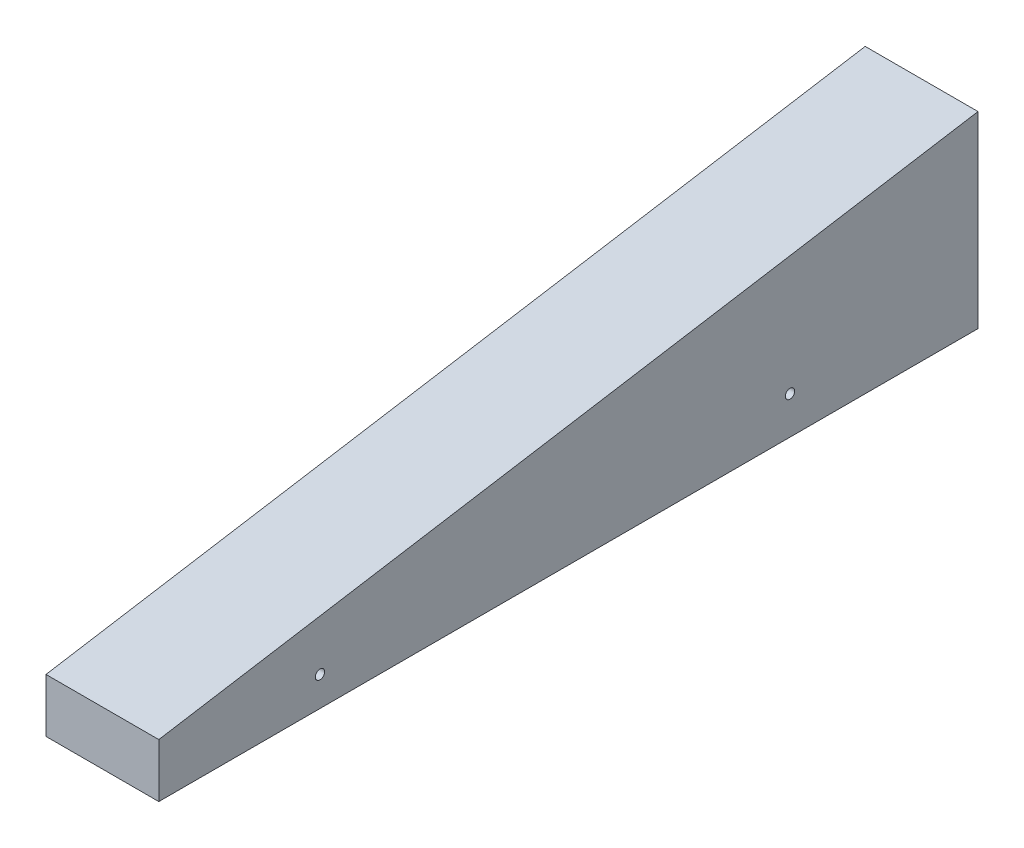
ISO-10303-21;
HEADER;
FILE_DESCRIPTION(('STEP AP214'),'2;1');
FILE_NAME('part.step','',(''),(''),'','','');
FILE_SCHEMA(('AUTOMOTIVE_DESIGN { 1 0 10303 214 1 1 1 1 }'));
ENDSEC;
DATA;
#1=APPLICATION_CONTEXT('core data for automotive mechanical design processes');
#2=APPLICATION_PROTOCOL_DEFINITION('international standard','automotive_design',2000,#1);
#3=PRODUCT_CONTEXT('',#1,'mechanical');
#4=PRODUCT('Part','Part','',(#3));
#5=PRODUCT_RELATED_PRODUCT_CATEGORY('part','',(#4));
#6=PRODUCT_DEFINITION_FORMATION('','',#4);
#7=PRODUCT_DEFINITION_CONTEXT('part definition',#1,'design');
#8=PRODUCT_DEFINITION('design','',#6,#7);
#9=PRODUCT_DEFINITION_SHAPE('','',#8);
#10=(LENGTH_UNIT() NAMED_UNIT(*) SI_UNIT(.MILLI.,.METRE.));
#11=(NAMED_UNIT(*) PLANE_ANGLE_UNIT() SI_UNIT($,.RADIAN.));
#12=(NAMED_UNIT(*) SI_UNIT($,.STERADIAN.) SOLID_ANGLE_UNIT());
#13=UNCERTAINTY_MEASURE_WITH_UNIT(LENGTH_MEASURE(1.E-05),#10,'distance_accuracy_value','');
#14=(GEOMETRIC_REPRESENTATION_CONTEXT(3) GLOBAL_UNCERTAINTY_ASSIGNED_CONTEXT((#13)) GLOBAL_UNIT_ASSIGNED_CONTEXT((#10,
#11,#12)) REPRESENTATION_CONTEXT('',''));
#15=CARTESIAN_POINT('',(0.,0.,0.));
#16=DIRECTION('',(0.,0.,1.));
#17=DIRECTION('',(1.,0.,0.));
#18=AXIS2_PLACEMENT_3D('',#15,#16,#17);
#19=CARTESIAN_POINT('',(21.,0.,152.5));
#20=DIRECTION('',(0.,0.,-1.));
#21=DIRECTION('',(-1.,0.,0.));
#22=AXIS2_PLACEMENT_3D('',#19,#20,#21);
#23=PLANE('',#22);
#24=DIRECTION('',(0.,-1.,0.));
#25=VECTOR('',#24,1.);
#26=CARTESIAN_POINT('',(-21.,0.,152.5));
#27=LINE('',#26,#25);
#28=CARTESIAN_POINT('',(-21.,20.,152.5));
#29=VERTEX_POINT('',#28);
#30=CARTESIAN_POINT('',(-21.,0.,152.5));
#31=VERTEX_POINT('',#30);
#32=EDGE_CURVE('E97',#29,#31,#27,.T.);
#33=ORIENTED_EDGE('',*,*,#32,.T.);
#34=DIRECTION('',(-1.,0.,0.));
#35=VECTOR('',#34,1.);
#36=CARTESIAN_POINT('',(21.,0.,152.5));
#37=LINE('',#36,#35);
#38=CARTESIAN_POINT('',(21.,0.,152.5));
#39=VERTEX_POINT('',#38);
#40=EDGE_CURVE('E11',#39,#31,#37,.T.);
#41=ORIENTED_EDGE('',*,*,#40,.F.);
#42=DIRECTION('',(0.,-1.,0.));
#43=VECTOR('',#42,1.);
#44=CARTESIAN_POINT('',(21.,0.,152.5));
#45=LINE('',#44,#43);
#46=CARTESIAN_POINT('',(21.,20.,152.5));
#47=VERTEX_POINT('',#46);
#48=EDGE_CURVE('E85',#47,#39,#45,.T.);
#49=ORIENTED_EDGE('',*,*,#48,.F.);
#50=DIRECTION('',(-1.,0.,0.));
#51=VECTOR('',#50,1.);
#52=CARTESIAN_POINT('',(21.,20.,152.5));
#53=LINE('',#52,#51);
#54=EDGE_CURVE('E93',#47,#29,#53,.T.);
#55=ORIENTED_EDGE('',*,*,#54,.T.);
#56=EDGE_LOOP('',(#33,#41,#49,#55));
#57=FACE_BOUND('',#56,.T.);
#58=ADVANCED_FACE('F34',(#57),#23,.F.);
#59=CARTESIAN_POINT('',(21.,0.,152.5));
#60=DIRECTION('',(0.,1.,0.));
#61=DIRECTION('',(0.,0.,1.));
#62=AXIS2_PLACEMENT_3D('',#59,#60,#61);
#63=PLANE('',#62);
#64=DIRECTION('',(0.,0.,-1.));
#65=VECTOR('',#64,1.);
#66=CARTESIAN_POINT('',(-21.,0.,152.5));
#67=LINE('',#66,#65);
#68=CARTESIAN_POINT('',(-21.,0.,-152.5));
#69=VERTEX_POINT('',#68);
#70=EDGE_CURVE('E89',#31,#69,#67,.T.);
#71=ORIENTED_EDGE('',*,*,#70,.T.);
#72=DIRECTION('',(-1.,0.,0.));
#73=VECTOR('',#72,1.);
#74=CARTESIAN_POINT('',(21.,0.,-152.5));
#75=LINE('',#74,#73);
#76=CARTESIAN_POINT('',(21.,0.,-152.5));
#77=VERTEX_POINT('',#76);
#78=EDGE_CURVE('E42',#77,#69,#75,.T.);
#79=ORIENTED_EDGE('',*,*,#78,.F.);
#80=DIRECTION('',(0.,0.,-1.));
#81=VECTOR('',#80,1.);
#82=CARTESIAN_POINT('',(21.,0.,152.5));
#83=LINE('',#82,#81);
#84=EDGE_CURVE('E80',#39,#77,#83,.T.);
#85=ORIENTED_EDGE('',*,*,#84,.F.);
#86=ORIENTED_EDGE('',*,*,#40,.T.);
#87=EDGE_LOOP('',(#71,#79,#85,#86));
#88=FACE_BOUND('',#87,.T.);
#89=ADVANCED_FACE('F88',(#88),#63,.F.);
#90=CARTESIAN_POINT('',(21.,0.,-152.5));
#91=DIRECTION('',(0.,0.,1.));
#92=DIRECTION('',(1.,0.,0.));
#93=AXIS2_PLACEMENT_3D('',#90,#91,#92);
#94=PLANE('',#93);
#95=CARTESIAN_POINT('',(0.,32.,-152.5));
#96=DIRECTION('',(0.,0.,-1.));
#97=DIRECTION('',(-1.,0.,0.));
#98=AXIS2_PLACEMENT_3D('',#95,#96,#97);
#99=CIRCLE('',#98,10.);
#100=CARTESIAN_POINT('',(-10.,32.,-152.5));
#101=VERTEX_POINT('',#100);
#102=EDGE_CURVE('E111',#101,#101,#99,.T.);
#103=ORIENTED_EDGE('',*,*,#102,.F.);
#104=EDGE_LOOP('',(#103));
#105=FACE_BOUND('',#104,.T.);
#106=DIRECTION('',(0.,1.,0.));
#107=VECTOR('',#106,1.);
#108=CARTESIAN_POINT('',(-21.,0.,-152.5));
#109=LINE('',#108,#107);
#110=CARTESIAN_POINT('',(-21.,70.,-152.5));
#111=VERTEX_POINT('',#110);
#112=EDGE_CURVE('E67',#69,#111,#109,.T.);
#113=ORIENTED_EDGE('',*,*,#112,.T.);
#114=DIRECTION('',(-1.,0.,0.));
#115=VECTOR('',#114,1.);
#116=CARTESIAN_POINT('',(21.,70.,-152.5));
#117=LINE('',#116,#115);
#118=CARTESIAN_POINT('',(21.,70.,-152.5));
#119=VERTEX_POINT('',#118);
#120=EDGE_CURVE('E90',#119,#111,#117,.T.);
#121=ORIENTED_EDGE('',*,*,#120,.F.);
#122=DIRECTION('',(0.,1.,0.));
#123=VECTOR('',#122,1.);
#124=CARTESIAN_POINT('',(21.,0.,-152.5));
#125=LINE('',#124,#123);
#126=EDGE_CURVE('E83',#77,#119,#125,.T.);
#127=ORIENTED_EDGE('',*,*,#126,.F.);
#128=ORIENTED_EDGE('',*,*,#78,.T.);
#129=EDGE_LOOP('',(#113,#121,#127,#128));
#130=FACE_BOUND('',#129,.T.);
#131=ADVANCED_FACE('F91',(#105,#130),#94,.F.);
#132=CARTESIAN_POINT('',(21.,20.,152.5));
#133=DIRECTION('',(0.,-0.986827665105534,-0.161775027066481));
#134=DIRECTION('',(0.,0.161775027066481,-0.986827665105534));
#135=AXIS2_PLACEMENT_3D('',#132,#133,#134);
#136=PLANE('',#135);
#137=DIRECTION('',(0.,-0.161775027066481,0.986827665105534));
#138=VECTOR('',#137,1.);
#139=CARTESIAN_POINT('',(-21.,20.,152.5));
#140=LINE('',#139,#138);
#141=EDGE_CURVE('E73',#111,#29,#140,.T.);
#142=ORIENTED_EDGE('',*,*,#141,.T.);
#143=ORIENTED_EDGE('',*,*,#54,.F.);
#144=DIRECTION('',(0.,-0.161775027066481,0.986827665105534));
#145=VECTOR('',#144,1.);
#146=CARTESIAN_POINT('',(21.,20.,152.5));
#147=LINE('',#146,#145);
#148=EDGE_CURVE('E50',#119,#47,#147,.T.);
#149=ORIENTED_EDGE('',*,*,#148,.F.);
#150=ORIENTED_EDGE('',*,*,#120,.T.);
#151=EDGE_LOOP('',(#142,#143,#149,#150));
#152=FACE_BOUND('',#151,.T.);
#153=ADVANCED_FACE('F105',(#152),#136,.F.);
#154=CARTESIAN_POINT('',(21.,0.,152.5));
#155=DIRECTION('',(-1.,0.,0.));
#156=DIRECTION('',(0.,0.,1.));
#157=AXIS2_PLACEMENT_3D('',#154,#155,#156);
#158=PLANE('',#157);
#159=CARTESIAN_POINT('',(21.,14.,-82.5));
#160=DIRECTION('',(1.,0.,0.));
#161=DIRECTION('',(0.,0.,-1.));
#162=AXIS2_PLACEMENT_3D('',#159,#160,#161);
#163=CIRCLE('',#162,1.75);
#164=CARTESIAN_POINT('',(21.,14.,-84.25));
#165=VERTEX_POINT('',#164);
#166=EDGE_CURVE('E125',#165,#165,#163,.T.);
#167=ORIENTED_EDGE('',*,*,#166,.F.);
#168=EDGE_LOOP('',(#167));
#169=FACE_BOUND('',#168,.T.);
#170=CARTESIAN_POINT('',(21.,11.,92.5));
#171=DIRECTION('',(1.,0.,0.));
#172=DIRECTION('',(0.,0.,-1.));
#173=AXIS2_PLACEMENT_3D('',#170,#171,#172);
#174=CIRCLE('',#173,1.75);
#175=CARTESIAN_POINT('',(21.,11.,90.75));
#176=VERTEX_POINT('',#175);
#177=EDGE_CURVE('E119',#176,#176,#174,.T.);
#178=ORIENTED_EDGE('',*,*,#177,.F.);
#179=EDGE_LOOP('',(#178));
#180=FACE_BOUND('',#179,.T.);
#181=ORIENTED_EDGE('',*,*,#48,.T.);
#182=ORIENTED_EDGE('',*,*,#84,.T.);
#183=ORIENTED_EDGE('',*,*,#126,.T.);
#184=ORIENTED_EDGE('',*,*,#148,.T.);
#185=EDGE_LOOP('',(#181,#182,#183,#184));
#186=FACE_BOUND('',#185,.T.);
#187=ADVANCED_FACE('F81',(#169,#180,#186),#158,.F.);
#188=CARTESIAN_POINT('',(-21.,0.,152.5));
#189=DIRECTION('',(-1.,0.,0.));
#190=DIRECTION('',(0.,0.,1.));
#191=AXIS2_PLACEMENT_3D('',#188,#189,#190);
#192=PLANE('',#191);
#193=CARTESIAN_POINT('',(-21.,14.,-82.5));
#194=DIRECTION('',(1.,0.,0.));
#195=DIRECTION('',(0.,0.,-1.));
#196=AXIS2_PLACEMENT_3D('',#193,#194,#195);
#197=CIRCLE('',#196,1.75);
#198=CARTESIAN_POINT('',(-21.,14.,-84.25));
#199=VERTEX_POINT('',#198);
#200=EDGE_CURVE('E122',#199,#199,#197,.T.);
#201=ORIENTED_EDGE('',*,*,#200,.T.);
#202=EDGE_LOOP('',(#201));
#203=FACE_BOUND('',#202,.T.);
#204=CARTESIAN_POINT('',(-21.,11.,92.5));
#205=DIRECTION('',(1.,0.,0.));
#206=DIRECTION('',(0.,0.,-1.));
#207=AXIS2_PLACEMENT_3D('',#204,#205,#206);
#208=CIRCLE('',#207,1.75);
#209=CARTESIAN_POINT('',(-21.,11.,90.75));
#210=VERTEX_POINT('',#209);
#211=EDGE_CURVE('E114',#210,#210,#208,.T.);
#212=ORIENTED_EDGE('',*,*,#211,.T.);
#213=EDGE_LOOP('',(#212));
#214=FACE_BOUND('',#213,.T.);
#215=ORIENTED_EDGE('',*,*,#32,.F.);
#216=ORIENTED_EDGE('',*,*,#141,.F.);
#217=ORIENTED_EDGE('',*,*,#112,.F.);
#218=ORIENTED_EDGE('',*,*,#70,.F.);
#219=EDGE_LOOP('',(#215,#216,#217,#218));
#220=FACE_BOUND('',#219,.T.);
#221=ADVANCED_FACE('F108',(#203,#214,#220),#192,.T.);
#222=CARTESIAN_POINT('',(0.,32.,-101.5));
#223=DIRECTION('',(0.,0.,-1.));
#224=DIRECTION('',(-1.,0.,0.));
#225=AXIS2_PLACEMENT_3D('',#222,#223,#224);
#226=CYLINDRICAL_SURFACE('',#225,10.);
#227=CARTESIAN_POINT('',(0.,32.,-101.5));
#228=DIRECTION('',(0.,0.,-1.));
#229=DIRECTION('',(-1.,0.,0.));
#230=AXIS2_PLACEMENT_3D('',#227,#228,#229);
#231=CIRCLE('',#230,10.);
#232=CARTESIAN_POINT('',(-10.,32.,-101.5));
#233=VERTEX_POINT('',#232);
#234=EDGE_CURVE('E100',#233,#233,#231,.T.);
#235=ORIENTED_EDGE('',*,*,#234,.F.);
#236=EDGE_LOOP('',(#235));
#237=FACE_BOUND('',#236,.T.);
#238=ORIENTED_EDGE('',*,*,#102,.T.);
#239=EDGE_LOOP('',(#238));
#240=FACE_BOUND('',#239,.T.);
#241=ADVANCED_FACE('F147',(#237,#240),#226,.F.);
#242=CARTESIAN_POINT('',(0.,32.,-101.5));
#243=DIRECTION('',(0.,0.,-1.));
#244=DIRECTION('',(-1.,0.,0.));
#245=AXIS2_PLACEMENT_3D('',#242,#243,#244);
#246=PLANE('',#245);
#247=ORIENTED_EDGE('',*,*,#234,.T.);
#248=EDGE_LOOP('',(#247));
#249=FACE_BOUND('',#248,.T.);
#250=ADVANCED_FACE('F138',(#249),#246,.T.);
#251=CARTESIAN_POINT('',(-21.,11.,92.5));
#252=DIRECTION('',(1.,0.,0.));
#253=DIRECTION('',(0.,0.,-1.));
#254=AXIS2_PLACEMENT_3D('',#251,#252,#253);
#255=CYLINDRICAL_SURFACE('',#254,1.75);
#256=CARTESIAN_POINT('',(-21.,11.,90.75));
#257=CARTESIAN_POINT('',(-20.5625,11.,90.75));
#258=CARTESIAN_POINT('',(-20.125,11.,90.75));
#259=CARTESIAN_POINT('',(-19.25,11.,90.75));
#260=CARTESIAN_POINT('',(-18.8125,11.,90.75));
#261=CARTESIAN_POINT('',(-17.9375,11.,90.75));
#262=CARTESIAN_POINT('',(-17.5,11.,90.75));
#263=CARTESIAN_POINT('',(-16.625,11.,90.75));
#264=CARTESIAN_POINT('',(-16.1875,11.,90.75));
#265=CARTESIAN_POINT('',(-15.3125,11.,90.75));
#266=CARTESIAN_POINT('',(-14.875,11.,90.75));
#267=CARTESIAN_POINT('',(-14.,11.,90.75));
#268=CARTESIAN_POINT('',(-13.5625,11.,90.75));
#269=CARTESIAN_POINT('',(-12.6875,11.,90.75));
#270=CARTESIAN_POINT('',(-12.25,11.,90.75));
#271=CARTESIAN_POINT('',(-11.375,11.,90.75));
#272=CARTESIAN_POINT('',(-10.9375,11.,90.75));
#273=CARTESIAN_POINT('',(-10.0625,11.,90.75));
#274=CARTESIAN_POINT('',(-9.625,11.,90.75));
#275=CARTESIAN_POINT('',(-8.75,11.,90.75));
#276=CARTESIAN_POINT('',(-8.3125,11.,90.75));
#277=CARTESIAN_POINT('',(-7.4375,11.,90.75));
#278=CARTESIAN_POINT('',(-7.,11.,90.75));
#279=CARTESIAN_POINT('',(-6.125,11.,90.75));
#280=CARTESIAN_POINT('',(-5.6875,11.,90.75));
#281=CARTESIAN_POINT('',(-4.8125,11.,90.75));
#282=CARTESIAN_POINT('',(-4.375,11.,90.75));
#283=CARTESIAN_POINT('',(-3.5,11.,90.75));
#284=CARTESIAN_POINT('',(-3.0625,11.,90.75));
#285=CARTESIAN_POINT('',(-2.1875,11.,90.75));
#286=CARTESIAN_POINT('',(-1.75,11.,90.75));
#287=CARTESIAN_POINT('',(-0.875000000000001,11.,90.75));
#288=CARTESIAN_POINT('',(-0.4375,11.,90.75));
#289=CARTESIAN_POINT('',(0.4375,11.,90.75));
#290=CARTESIAN_POINT('',(0.875000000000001,11.,90.75));
#291=CARTESIAN_POINT('',(1.75,11.,90.75));
#292=CARTESIAN_POINT('',(2.1875,11.,90.75));
#293=CARTESIAN_POINT('',(3.0625,11.,90.75));
#294=CARTESIAN_POINT('',(3.5,11.,90.75));
#295=CARTESIAN_POINT('',(4.375,11.,90.75));
#296=CARTESIAN_POINT('',(4.8125,11.,90.75));
#297=CARTESIAN_POINT('',(5.6875,11.,90.75));
#298=CARTESIAN_POINT('',(6.125,11.,90.75));
#299=CARTESIAN_POINT('',(7.,11.,90.75));
#300=CARTESIAN_POINT('',(7.4375,11.,90.75));
#301=CARTESIAN_POINT('',(8.3125,11.,90.75));
#302=CARTESIAN_POINT('',(8.75,11.,90.75));
#303=CARTESIAN_POINT('',(9.625,11.,90.75));
#304=CARTESIAN_POINT('',(10.0625,11.,90.75));
#305=CARTESIAN_POINT('',(10.9375,11.,90.75));
#306=CARTESIAN_POINT('',(11.375,11.,90.75));
#307=CARTESIAN_POINT('',(12.25,11.,90.75));
#308=CARTESIAN_POINT('',(12.6875,11.,90.75));
#309=CARTESIAN_POINT('',(13.5625,11.,90.75));
#310=CARTESIAN_POINT('',(14.,11.,90.75));
#311=CARTESIAN_POINT('',(14.875,11.,90.75));
#312=CARTESIAN_POINT('',(15.3125,11.,90.75));
#313=CARTESIAN_POINT('',(16.1875,11.,90.75));
#314=CARTESIAN_POINT('',(16.625,11.,90.75));
#315=CARTESIAN_POINT('',(17.5,11.,90.75));
#316=CARTESIAN_POINT('',(17.9375,11.,90.75));
#317=CARTESIAN_POINT('',(18.8125,11.,90.75));
#318=CARTESIAN_POINT('',(19.25,11.,90.75));
#319=CARTESIAN_POINT('',(20.125,11.,90.75));
#320=CARTESIAN_POINT('',(20.5625,11.,90.75));
#321=CARTESIAN_POINT('',(21.,11.,90.75));
#322=B_SPLINE_CURVE_WITH_KNOTS('',3,(#256,#257,#258,#259,#260,#261,#262,#263,#264,#265,#266,
#267,#268,#269,#270,#271,#272,#273,#274,#275,#276,#277,#278,#279,#280,#281,#282,#283,#284,#285,
#286,#287,#288,#289,#290,#291,#292,#293,#294,#295,#296,#297,#298,#299,#300,#301,#302,#303,#304,
#305,#306,#307,#308,#309,#310,#311,#312,#313,#314,#315,#316,#317,#318,#319,#320,#321),
.UNSPECIFIED.,.F.,.F.,(4,2,2,2,2,2,2,2,2,2,2,2,2,2,2,2,2,2,2,2,2,2,2,2,2,2,2,2,2,2,2,2,4),(0.,
1.3125,2.625,3.9375,5.25,6.5625,7.875,9.1875,10.5,11.8125,13.125,14.4375,15.75,17.0625,18.375,
19.6875,21.,22.3125,23.625,24.9375,26.25,27.5625,28.875,30.1875,31.5,32.8125,34.125,35.4375,
36.75,38.0625,39.375,40.6875,42.),.UNSPECIFIED.);
#323=EDGE_CURVE('BSEAM136',#210,#176,#322,.T.);
#324=ORIENTED_EDGE('',*,*,#211,.F.);
#325=ORIENTED_EDGE('',*,*,#177,.T.);
#326=ORIENTED_EDGE('',*,*,#323,.T.);
#327=ORIENTED_EDGE('',*,*,#323,.F.);
#328=EDGE_LOOP('',(#324,#326,#325,#327));
#329=FACE_BOUND('',#328,.T.);
#330=ADVANCED_FACE('F136',(#329),#255,.F.);
#331=CARTESIAN_POINT('',(-21.,14.,-82.5));
#332=DIRECTION('',(1.,0.,0.));
#333=DIRECTION('',(0.,0.,-1.));
#334=AXIS2_PLACEMENT_3D('',#331,#332,#333);
#335=CYLINDRICAL_SURFACE('',#334,1.75);
#336=CARTESIAN_POINT('',(-21.,14.,-84.25));
#337=CARTESIAN_POINT('',(-20.5625,14.,-84.25));
#338=CARTESIAN_POINT('',(-20.125,14.,-84.25));
#339=CARTESIAN_POINT('',(-19.25,14.,-84.25));
#340=CARTESIAN_POINT('',(-18.8125,14.,-84.25));
#341=CARTESIAN_POINT('',(-17.9375,14.,-84.25));
#342=CARTESIAN_POINT('',(-17.5,14.,-84.25));
#343=CARTESIAN_POINT('',(-16.625,14.,-84.25));
#344=CARTESIAN_POINT('',(-16.1875,14.,-84.25));
#345=CARTESIAN_POINT('',(-15.3125,14.,-84.25));
#346=CARTESIAN_POINT('',(-14.875,14.,-84.25));
#347=CARTESIAN_POINT('',(-14.,14.,-84.25));
#348=CARTESIAN_POINT('',(-13.5625,14.,-84.25));
#349=CARTESIAN_POINT('',(-12.6875,14.,-84.25));
#350=CARTESIAN_POINT('',(-12.25,14.,-84.25));
#351=CARTESIAN_POINT('',(-11.375,14.,-84.25));
#352=CARTESIAN_POINT('',(-10.9375,14.,-84.25));
#353=CARTESIAN_POINT('',(-10.0625,14.,-84.25));
#354=CARTESIAN_POINT('',(-9.625,14.,-84.25));
#355=CARTESIAN_POINT('',(-8.75,14.,-84.25));
#356=CARTESIAN_POINT('',(-8.3125,14.,-84.25));
#357=CARTESIAN_POINT('',(-7.4375,14.,-84.25));
#358=CARTESIAN_POINT('',(-7.,14.,-84.25));
#359=CARTESIAN_POINT('',(-6.125,14.,-84.25));
#360=CARTESIAN_POINT('',(-5.6875,14.,-84.25));
#361=CARTESIAN_POINT('',(-4.8125,14.,-84.25));
#362=CARTESIAN_POINT('',(-4.375,14.,-84.25));
#363=CARTESIAN_POINT('',(-3.5,14.,-84.25));
#364=CARTESIAN_POINT('',(-3.0625,14.,-84.25));
#365=CARTESIAN_POINT('',(-2.1875,14.,-84.25));
#366=CARTESIAN_POINT('',(-1.75,14.,-84.25));
#367=CARTESIAN_POINT('',(-0.875000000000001,14.,-84.25));
#368=CARTESIAN_POINT('',(-0.4375,14.,-84.25));
#369=CARTESIAN_POINT('',(0.4375,14.,-84.25));
#370=CARTESIAN_POINT('',(0.875000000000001,14.,-84.25));
#371=CARTESIAN_POINT('',(1.75,14.,-84.25));
#372=CARTESIAN_POINT('',(2.1875,14.,-84.25));
#373=CARTESIAN_POINT('',(3.0625,14.,-84.25));
#374=CARTESIAN_POINT('',(3.5,14.,-84.25));
#375=CARTESIAN_POINT('',(4.375,14.,-84.25));
#376=CARTESIAN_POINT('',(4.8125,14.,-84.25));
#377=CARTESIAN_POINT('',(5.6875,14.,-84.25));
#378=CARTESIAN_POINT('',(6.125,14.,-84.25));
#379=CARTESIAN_POINT('',(7.,14.,-84.25));
#380=CARTESIAN_POINT('',(7.4375,14.,-84.25));
#381=CARTESIAN_POINT('',(8.3125,14.,-84.25));
#382=CARTESIAN_POINT('',(8.75,14.,-84.25));
#383=CARTESIAN_POINT('',(9.625,14.,-84.25));
#384=CARTESIAN_POINT('',(10.0625,14.,-84.25));
#385=CARTESIAN_POINT('',(10.9375,14.,-84.25));
#386=CARTESIAN_POINT('',(11.375,14.,-84.25));
#387=CARTESIAN_POINT('',(12.25,14.,-84.25));
#388=CARTESIAN_POINT('',(12.6875,14.,-84.25));
#389=CARTESIAN_POINT('',(13.5625,14.,-84.25));
#390=CARTESIAN_POINT('',(14.,14.,-84.25));
#391=CARTESIAN_POINT('',(14.875,14.,-84.25));
#392=CARTESIAN_POINT('',(15.3125,14.,-84.25));
#393=CARTESIAN_POINT('',(16.1875,14.,-84.25));
#394=CARTESIAN_POINT('',(16.625,14.,-84.25));
#395=CARTESIAN_POINT('',(17.5,14.,-84.25));
#396=CARTESIAN_POINT('',(17.9375,14.,-84.25));
#397=CARTESIAN_POINT('',(18.8125,14.,-84.25));
#398=CARTESIAN_POINT('',(19.25,14.,-84.25));
#399=CARTESIAN_POINT('',(20.125,14.,-84.25));
#400=CARTESIAN_POINT('',(20.5625,14.,-84.25));
#401=CARTESIAN_POINT('',(21.,14.,-84.25));
#402=B_SPLINE_CURVE_WITH_KNOTS('',3,(#336,#337,#338,#339,#340,#341,#342,#343,#344,#345,#346,
#347,#348,#349,#350,#351,#352,#353,#354,#355,#356,#357,#358,#359,#360,#361,#362,#363,#364,#365,
#366,#367,#368,#369,#370,#371,#372,#373,#374,#375,#376,#377,#378,#379,#380,#381,#382,#383,#384,
#385,#386,#387,#388,#389,#390,#391,#392,#393,#394,#395,#396,#397,#398,#399,#400,#401),
.UNSPECIFIED.,.F.,.F.,(4,2,2,2,2,2,2,2,2,2,2,2,2,2,2,2,2,2,2,2,2,2,2,2,2,2,2,2,2,2,2,2,4),(0.,
1.3125,2.625,3.9375,5.25,6.5625,7.875,9.1875,10.5,11.8125,13.125,14.4375,15.75,17.0625,18.375,
19.6875,21.,22.3125,23.625,24.9375,26.25,27.5625,28.875,30.1875,31.5,32.8125,34.125,35.4375,
36.75,38.0625,39.375,40.6875,42.),.UNSPECIFIED.);
#403=EDGE_CURVE('BSEAM129',#199,#165,#402,.T.);
#404=ORIENTED_EDGE('',*,*,#200,.F.);
#405=ORIENTED_EDGE('',*,*,#166,.T.);
#406=ORIENTED_EDGE('',*,*,#403,.T.);
#407=ORIENTED_EDGE('',*,*,#403,.F.);
#408=EDGE_LOOP('',(#404,#406,#405,#407));
#409=FACE_BOUND('',#408,.T.);
#410=ADVANCED_FACE('F129',(#409),#335,.F.);
#411=CLOSED_SHELL('',(#58,#89,#131,#153,#187,#221,#241,#250,#330,#410));
#412=MANIFOLD_SOLID_BREP('B2',#411);
#413=ADVANCED_BREP_SHAPE_REPRESENTATION('',(#18,#412),#14);
#414=SHAPE_DEFINITION_REPRESENTATION(#9,#413);
ENDSEC;
END-ISO-10303-21;
